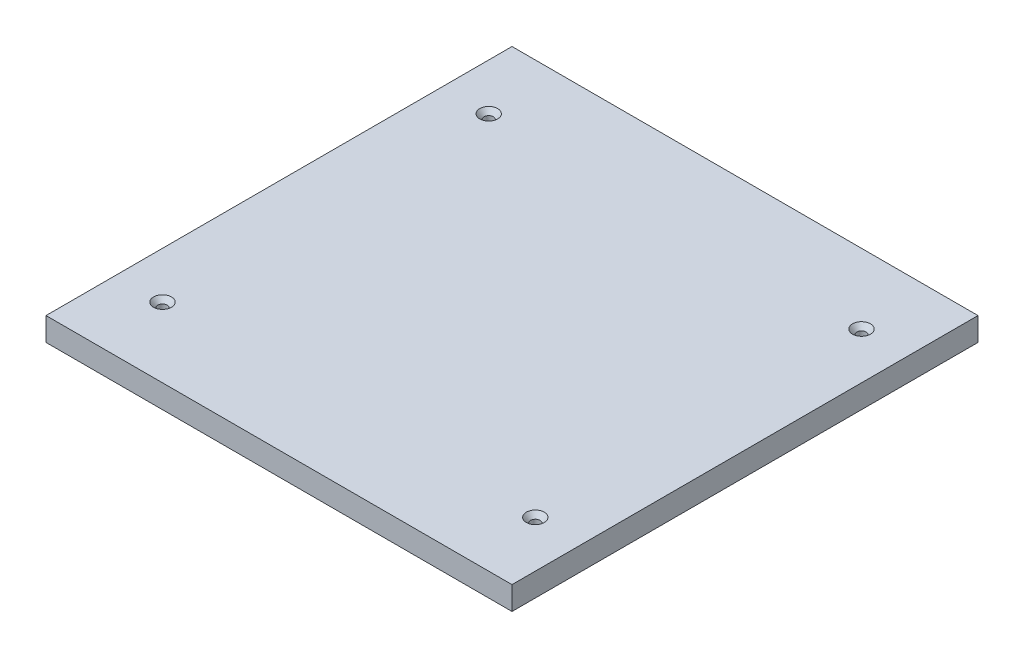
from build123d import *

# Parameters (mm, degrees)
SKETCH1_W                                       = 254
SKETCH1_H                                       = 254
BOSS_EXTRUDE1_DEPTH                             = 12.7
CSK_FOR_10_FLAT_HEAD_MACHINE_SCREW1_D           = 5.1054
CSK_FOR_10_FLAT_HEAD_MACHINE_SCREW1_CSINK_D     = 9.779
CSK_FOR_10_FLAT_HEAD_MACHINE_SCREW1_CSINK_ANGLE = 82


with BuildPart() as part:
    # Sketch1 → Boss-Extrude1 (new body)
    with BuildSketch(Plane(origin=(0, 0, 0), x_dir=(1, 0, 0), z_dir=(0, 1, 0))):
        Rectangle(SKETCH1_W, SKETCH1_H)
    extrude(amount=BOSS_EXTRUDE1_DEPTH)

    # CSK for _10 Flat Head Machine Screw1 (through all)
    with Locations(Plane(origin=(-101.6, 12.7, -88.9), x_dir=(0, 0, 1), z_dir=(0, 1, 0))):
        with Locations((0, 0), (0, 203.2), (177.8, 0), (177.8, 203.2)):
            CounterSinkHole(CSK_FOR_10_FLAT_HEAD_MACHINE_SCREW1_D / 2, CSK_FOR_10_FLAT_HEAD_MACHINE_SCREW1_CSINK_D / 2, counter_sink_angle=CSK_FOR_10_FLAT_HEAD_MACHINE_SCREW1_CSINK_ANGLE)


solid = part.part
